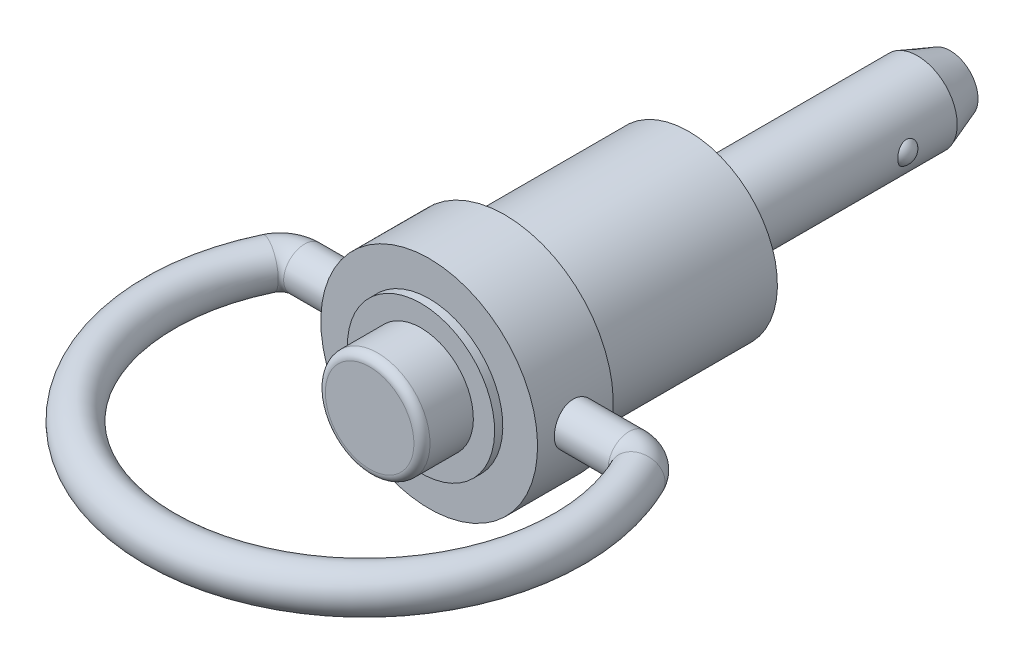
ISO-10303-21;
HEADER;
FILE_DESCRIPTION(('STEP AP214'),'2;1');
FILE_NAME('part.step','',(''),(''),'','','');
FILE_SCHEMA(('AUTOMOTIVE_DESIGN { 1 0 10303 214 1 1 1 1 }'));
ENDSEC;
DATA;
#1=APPLICATION_CONTEXT('core data for automotive mechanical design processes');
#2=APPLICATION_PROTOCOL_DEFINITION('international standard','automotive_design',2000,#1);
#3=PRODUCT_CONTEXT('',#1,'mechanical');
#4=PRODUCT('Part','Part','',(#3));
#5=PRODUCT_RELATED_PRODUCT_CATEGORY('part','',(#4));
#6=PRODUCT_DEFINITION_FORMATION('','',#4);
#7=PRODUCT_DEFINITION_CONTEXT('part definition',#1,'design');
#8=PRODUCT_DEFINITION('design','',#6,#7);
#9=PRODUCT_DEFINITION_SHAPE('','',#8);
#10=(LENGTH_UNIT() NAMED_UNIT(*) SI_UNIT(.MILLI.,.METRE.));
#11=(NAMED_UNIT(*) PLANE_ANGLE_UNIT() SI_UNIT($,.RADIAN.));
#12=(NAMED_UNIT(*) SI_UNIT($,.STERADIAN.) SOLID_ANGLE_UNIT());
#13=UNCERTAINTY_MEASURE_WITH_UNIT(LENGTH_MEASURE(1.E-05),#10,'distance_accuracy_value','');
#14=(GEOMETRIC_REPRESENTATION_CONTEXT(3) GLOBAL_UNCERTAINTY_ASSIGNED_CONTEXT((#13)) GLOBAL_UNIT_ASSIGNED_CONTEXT((#10,
#11,#12)) REPRESENTATION_CONTEXT('',''));
#15=CARTESIAN_POINT('',(0.,0.,0.));
#16=DIRECTION('',(0.,0.,1.));
#17=DIRECTION('',(1.,0.,0.));
#18=AXIS2_PLACEMENT_3D('',#15,#16,#17);
#19=CARTESIAN_POINT('',(0.,0.,20.828));
#20=DIRECTION('',(0.,0.,-1.));
#21=DIRECTION('',(0.,1.,0.));
#22=AXIS2_PLACEMENT_3D('',#19,#20,#21);
#23=CYLINDRICAL_SURFACE('',#22,3.2512);
#24=CARTESIAN_POINT('',(0.,0.,16.637));
#25=DIRECTION('',(0.,0.,-1.));
#26=DIRECTION('',(0.,1.,0.));
#27=AXIS2_PLACEMENT_3D('',#24,#25,#26);
#28=CIRCLE('',#27,3.2512);
#29=CARTESIAN_POINT('',(0.,3.25120000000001,16.637));
#30=VERTEX_POINT('',#29);
#31=EDGE_CURVE('E30',#30,#30,#28,.T.);
#32=ORIENTED_EDGE('',*,*,#31,.F.);
#33=EDGE_LOOP('',(#32));
#34=FACE_BOUND('',#33,.T.);
#35=CARTESIAN_POINT('',(0.,0.,19.328));
#36=DIRECTION('',(0.,0.,1.));
#37=DIRECTION('',(1.,0.,0.));
#38=AXIS2_PLACEMENT_3D('',#35,#36,#37);
#39=CIRCLE('',#38,3.2512);
#40=CARTESIAN_POINT('',(3.2512,0.,19.328));
#41=VERTEX_POINT('',#40);
#42=EDGE_CURVE('E136',#41,#41,#39,.T.);
#43=ORIENTED_EDGE('',*,*,#42,.F.);
#44=EDGE_LOOP('',(#43));
#45=FACE_BOUND('',#44,.T.);
#46=ADVANCED_FACE('F12',(#34,#45),#23,.T.);
#47=CARTESIAN_POINT('',(4.572,0.,16.637));
#48=DIRECTION('',(0.,0.,1.));
#49=DIRECTION('',(0.,-1.,0.));
#50=AXIS2_PLACEMENT_3D('',#47,#48,#49);
#51=PLANE('',#50);
#52=ORIENTED_EDGE('',*,*,#31,.T.);
#53=EDGE_LOOP('',(#52));
#54=FACE_BOUND('',#53,.T.);
#55=CARTESIAN_POINT('',(0.,0.,16.637));
#56=DIRECTION('',(0.,0.,-1.));
#57=DIRECTION('',(0.,1.,0.));
#58=AXIS2_PLACEMENT_3D('',#55,#56,#57);
#59=CIRCLE('',#58,4.572);
#60=CARTESIAN_POINT('',(0.,4.57200000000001,16.637));
#61=VERTEX_POINT('',#60);
#62=EDGE_CURVE('E35',#61,#61,#59,.T.);
#63=ORIENTED_EDGE('',*,*,#62,.F.);
#64=EDGE_LOOP('',(#63));
#65=FACE_BOUND('',#64,.T.);
#66=ADVANCED_FACE('F78',(#54,#65),#51,.T.);
#67=CARTESIAN_POINT('',(0.,0.,0.));
#68=DIRECTION('',(0.,0.,-1.));
#69=DIRECTION('',(0.,1.,0.));
#70=AXIS2_PLACEMENT_3D('',#67,#68,#69);
#71=CYLINDRICAL_SURFACE('',#70,4.572);
#72=ORIENTED_EDGE('',*,*,#62,.T.);
#73=EDGE_LOOP('',(#72));
#74=FACE_BOUND('',#73,.T.);
#75=CARTESIAN_POINT('',(0.,0.,16.129));
#76=DIRECTION('',(0.,0.,-1.));
#77=DIRECTION('',(0.,1.,0.));
#78=AXIS2_PLACEMENT_3D('',#75,#76,#77);
#79=CIRCLE('',#78,4.572);
#80=CARTESIAN_POINT('',(0.,4.57200000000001,16.129));
#81=VERTEX_POINT('',#80);
#82=EDGE_CURVE('E38',#81,#81,#79,.T.);
#83=ORIENTED_EDGE('',*,*,#82,.F.);
#84=EDGE_LOOP('',(#83));
#85=FACE_BOUND('',#84,.T.);
#86=ADVANCED_FACE('F155',(#74,#85),#71,.T.);
#87=CARTESIAN_POINT('',(6.731,0.,16.129));
#88=DIRECTION('',(0.,0.,1.));
#89=DIRECTION('',(0.,-1.,0.));
#90=AXIS2_PLACEMENT_3D('',#87,#88,#89);
#91=PLANE('',#90);
#92=CARTESIAN_POINT('',(0.,0.,16.129));
#93=DIRECTION('',(0.,0.,-1.));
#94=DIRECTION('',(0.,1.,0.));
#95=AXIS2_PLACEMENT_3D('',#92,#93,#94);
#96=CIRCLE('',#95,6.731);
#97=CARTESIAN_POINT('',(0.,6.73100000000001,16.129));
#98=VERTEX_POINT('',#97);
#99=EDGE_CURVE('E41',#98,#98,#96,.T.);
#100=ORIENTED_EDGE('',*,*,#99,.F.);
#101=EDGE_LOOP('',(#100));
#102=FACE_BOUND('',#101,.T.);
#103=ORIENTED_EDGE('',*,*,#82,.T.);
#104=EDGE_LOOP('',(#103));
#105=FACE_BOUND('',#104,.T.);
#106=ADVANCED_FACE('F196',(#102,#105),#91,.T.);
#107=CARTESIAN_POINT('',(0.,0.,0.));
#108=DIRECTION('',(0.,0.,-1.));
#109=DIRECTION('',(0.,1.,0.));
#110=AXIS2_PLACEMENT_3D('',#107,#108,#109);
#111=CYLINDRICAL_SURFACE('',#110,6.731);
#112=ORIENTED_EDGE('',*,*,#99,.T.);
#113=EDGE_LOOP('',(#112));
#114=FACE_BOUND('',#113,.T.);
#115=CARTESIAN_POINT('',(0.,0.,11.43));
#116=DIRECTION('',(0.,0.,-1.));
#117=DIRECTION('',(0.,1.,0.));
#118=AXIS2_PLACEMENT_3D('',#115,#116,#117);
#119=CIRCLE('',#118,6.731);
#120=CARTESIAN_POINT('',(0.,6.73100000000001,11.43));
#121=VERTEX_POINT('',#120);
#122=EDGE_CURVE('E44',#121,#121,#119,.T.);
#123=ORIENTED_EDGE('',*,*,#122,.F.);
#124=EDGE_LOOP('',(#123));
#125=FACE_BOUND('',#124,.T.);
#126=CARTESIAN_POINT('',(-6.60517220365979,1.2954,13.7922));
#127=CARTESIAN_POINT('',(-6.60517361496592,1.2953972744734,13.864236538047));
#128=CARTESIAN_POINT('',(-6.60636346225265,1.2893707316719,13.9363080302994));
#129=CARTESIAN_POINT('',(-6.61098794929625,1.26544153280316,14.0784162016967));
#130=CARTESIAN_POINT('',(-6.61442445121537,1.24752902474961,14.1484511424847));
#131=CARTESIAN_POINT('',(-6.62313895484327,1.20040052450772,14.2844095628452));
#132=CARTESIAN_POINT('',(-6.62841519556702,1.17119533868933,14.3503369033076));
#133=CARTESIAN_POINT('',(-6.64021258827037,1.10233951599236,14.4763528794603));
#134=CARTESIAN_POINT('',(-6.64673365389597,1.06268960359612,14.5364419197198));
#135=CARTESIAN_POINT('',(-6.66038139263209,0.973516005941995,14.6498669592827));
#136=CARTESIAN_POINT('',(-6.66751428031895,0.923881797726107,14.7031153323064));
#137=CARTESIAN_POINT('',(-6.68152715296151,0.816387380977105,14.8005834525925));
#138=CARTESIAN_POINT('',(-6.6884071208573,0.758526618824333,14.8448025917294));
#139=CARTESIAN_POINT('',(-6.7012057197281,0.635644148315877,14.9232944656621));
#140=CARTESIAN_POINT('',(-6.70711617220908,0.570568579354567,14.9574843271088));
#141=CARTESIAN_POINT('',(-6.71724013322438,0.435464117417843,15.014412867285));
#142=CARTESIAN_POINT('',(-6.72145378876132,0.365435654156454,15.0371525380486));
#143=CARTESIAN_POINT('',(-6.72766549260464,0.223321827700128,15.0702635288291));
#144=CARTESIAN_POINT('',(-6.72968999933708,0.15127208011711,15.0807826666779));
#145=CARTESIAN_POINT('',(-6.73138656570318,0.00640388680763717,15.089614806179));
#146=CARTESIAN_POINT('',(-6.73105883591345,-0.0664144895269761,15.0879289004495));
#147=CARTESIAN_POINT('',(-6.72810846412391,-0.20973839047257,15.072511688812));
#148=CARTESIAN_POINT('',(-6.72551615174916,-0.280261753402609,15.0589395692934));
#149=CARTESIAN_POINT('',(-6.71836197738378,-0.418011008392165,15.0203872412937));
#150=CARTESIAN_POINT('',(-6.71380004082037,-0.485236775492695,14.9954066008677));
#151=CARTESIAN_POINT('',(-6.70316878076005,-0.614941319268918,14.9345963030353));
#152=CARTESIAN_POINT('',(-6.69709072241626,-0.677389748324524,14.8987035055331));
#153=CARTESIAN_POINT('',(-6.68409856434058,-0.795436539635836,14.8171343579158));
#154=CARTESIAN_POINT('',(-6.677184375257,-0.851034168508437,14.7714569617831));
#155=CARTESIAN_POINT('',(-6.66315320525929,-0.95474491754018,14.6707395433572));
#156=CARTESIAN_POINT('',(-6.65603475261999,-1.00272266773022,14.6155602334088));
#157=CARTESIAN_POINT('',(-6.64250376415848,-1.08876420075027,14.4978679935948));
#158=CARTESIAN_POINT('',(-6.63609123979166,-1.12682782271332,14.4353549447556));
#159=CARTESIAN_POINT('',(-6.62469571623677,-1.19200234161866,14.3045844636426));
#160=CARTESIAN_POINT('',(-6.61971540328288,-1.21909269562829,14.2363165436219));
#161=CARTESIAN_POINT('',(-6.61178862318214,-1.26138008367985,14.0960804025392));
#162=CARTESIAN_POINT('',(-6.60884191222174,-1.27657854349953,14.0241126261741));
#163=CARTESIAN_POINT('',(-6.60536444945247,-1.29445125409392,13.8797427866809));
#164=CARTESIAN_POINT('',(-6.60479610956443,-1.29732037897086,13.8073657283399));
#165=CARTESIAN_POINT('',(-6.60603903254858,-1.29097613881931,13.6631669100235));
#166=CARTESIAN_POINT('',(-6.60785017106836,-1.28176340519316,13.5913451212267));
#167=CARTESIAN_POINT('',(-6.6136128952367,-1.25168453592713,13.4509418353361));
#168=CARTESIAN_POINT('',(-6.61754556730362,-1.23092132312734,13.3823374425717));
#169=CARTESIAN_POINT('',(-6.62709183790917,-1.17844042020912,13.249581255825));
#170=CARTESIAN_POINT('',(-6.63270556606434,-1.14672188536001,13.1854298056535));
#171=CARTESIAN_POINT('',(-6.64506657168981,-1.07278507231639,13.0625442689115));
#172=CARTESIAN_POINT('',(-6.65182676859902,-1.03044414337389,13.0038853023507));
#173=CARTESIAN_POINT('',(-6.66568301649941,-0.93662909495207,12.8944341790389));
#174=CARTESIAN_POINT('',(-6.67277909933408,-0.885154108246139,12.8436427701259));
#175=CARTESIAN_POINT('',(-6.68662882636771,-0.77366002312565,12.7506362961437));
#176=CARTESIAN_POINT('',(-6.69337621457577,-0.713530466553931,12.7085525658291));
#177=CARTESIAN_POINT('',(-6.70566168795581,-0.58694148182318,12.6350847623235));
#178=CARTESIAN_POINT('',(-6.71119982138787,-0.520482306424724,12.6037002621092));
#179=CARTESIAN_POINT('',(-6.72041595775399,-0.383476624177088,12.5527164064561));
#180=CARTESIAN_POINT('',(-6.72410395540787,-0.312954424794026,12.5330536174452));
#181=CARTESIAN_POINT('',(-6.72924701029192,-0.169530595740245,12.5058694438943));
#182=CARTESIAN_POINT('',(-6.7307023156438,-0.0966292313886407,12.4983467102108));
#183=CARTESIAN_POINT('',(-6.73121071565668,0.0482259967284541,12.4957052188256));
#184=CARTESIAN_POINT('',(-6.73030215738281,0.1201761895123,12.5003884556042));
#185=CARTESIAN_POINT('',(-6.72626496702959,0.262244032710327,12.5215909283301));
#186=CARTESIAN_POINT('',(-6.72313635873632,0.332361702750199,12.5381100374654));
#187=CARTESIAN_POINT('',(-6.71501101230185,0.468662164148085,12.5824301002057));
#188=CARTESIAN_POINT('',(-6.710017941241,0.534852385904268,12.6102089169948));
#189=CARTESIAN_POINT('',(-6.69870305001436,0.661661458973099,12.6762356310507));
#190=CARTESIAN_POINT('',(-6.69238113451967,0.722279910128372,12.7144842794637));
#191=CARTESIAN_POINT('',(-6.6789853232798,0.83720844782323,12.8010411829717));
#192=CARTESIAN_POINT('',(-6.67190155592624,0.891410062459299,12.8494919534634));
#193=CARTESIAN_POINT('',(-6.65784127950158,0.990982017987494,12.95478313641));
#194=CARTESIAN_POINT('',(-6.65086479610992,1.03635027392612,13.0116255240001));
#195=CARTESIAN_POINT('',(-6.63773378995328,1.1173887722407,13.1327559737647));
#196=CARTESIAN_POINT('',(-6.63158802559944,1.15295925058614,13.1971117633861));
#197=CARTESIAN_POINT('',(-6.62092027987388,1.21272619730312,13.3309847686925));
#198=CARTESIAN_POINT('',(-6.61639678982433,1.23693323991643,13.4004971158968));
#199=CARTESIAN_POINT('',(-6.61041337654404,1.26845390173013,13.5238636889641));
#200=CARTESIAN_POINT('',(-6.60845980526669,1.27854107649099,13.57700269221));
#201=CARTESIAN_POINT('',(-6.60583870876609,1.29201504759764,13.6841545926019));
#202=CARTESIAN_POINT('',(-6.60517114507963,1.29540204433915,13.7381674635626));
#203=CARTESIAN_POINT('',(-6.60517220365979,1.2954,13.7922));
#204=B_SPLINE_CURVE_WITH_KNOTS('',3,(#126,#127,#128,#129,#130,#131,#132,#133,#134,#135,#136,
#137,#138,#139,#140,#141,#142,#143,#144,#145,#146,#147,#148,#149,#150,#151,#152,#153,#154,#155,
#156,#157,#158,#159,#160,#161,#162,#163,#164,#165,#166,#167,#168,#169,#170,#171,#172,#173,#174,
#175,#176,#177,#178,#179,#180,#181,#182,#183,#184,#185,#186,#187,#188,#189,#190,#191,#192,#193,
#194,#195,#196,#197,#198,#199,#200,#201,#202,#203),.UNSPECIFIED.,.T.,.F.,(4,2,2,2,2,2,2,2,2,2,2,
2,2,2,2,2,2,2,2,2,2,2,2,2,2,2,2,2,2,2,2,2,2,2,2,2,2,2,4),(0.,0.215911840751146,
0.432002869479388,0.647887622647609,0.863757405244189,1.08216318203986,1.30058366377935,
1.52076118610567,1.74091962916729,1.95838638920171,2.1758336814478,2.39041258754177,
2.60499961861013,2.82085272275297,3.0367289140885,3.25609136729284,3.47545737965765,
3.69523218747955,3.91498064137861,4.13124273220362,4.34749352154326,4.56184753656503,
4.7762180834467,4.99318797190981,5.21017847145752,5.43023526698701,5.65028327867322,
5.86912939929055,6.08795119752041,6.30324544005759,6.51853737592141,6.73340808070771,
6.94829420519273,7.16640910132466,7.38457541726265,7.60488731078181,7.82499378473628,
7.98694789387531,8.14889715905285),.UNSPECIFIED.);
#205=CARTESIAN_POINT('',(-6.60517220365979,1.2954,13.7922));
#206=VERTEX_POINT('',#205);
#207=EDGE_CURVE('E27',#206,#206,#204,.T.);
#208=ORIENTED_EDGE('',*,*,#207,.T.);
#209=EDGE_LOOP('',(#208));
#210=FACE_BOUND('',#209,.T.);
#211=CARTESIAN_POINT('',(6.60517220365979,1.2954,13.7922));
#212=CARTESIAN_POINT('',(6.60517361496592,1.2953972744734,13.720163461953));
#213=CARTESIAN_POINT('',(6.60636346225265,1.2893707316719,13.6480919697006));
#214=CARTESIAN_POINT('',(6.61098794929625,1.26544153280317,13.5059837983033));
#215=CARTESIAN_POINT('',(6.61442445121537,1.24752902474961,13.4359488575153));
#216=CARTESIAN_POINT('',(6.62313895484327,1.20040052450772,13.2999904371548));
#217=CARTESIAN_POINT('',(6.62841519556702,1.17119533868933,13.2340630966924));
#218=CARTESIAN_POINT('',(6.64021258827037,1.10233951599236,13.1080471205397));
#219=CARTESIAN_POINT('',(6.64673365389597,1.06268960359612,13.0479580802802));
#220=CARTESIAN_POINT('',(6.66038139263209,0.973516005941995,12.9345330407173));
#221=CARTESIAN_POINT('',(6.66751428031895,0.923881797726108,12.8812846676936));
#222=CARTESIAN_POINT('',(6.68152715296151,0.816387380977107,12.7838165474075));
#223=CARTESIAN_POINT('',(6.6884071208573,0.758526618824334,12.7395974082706));
#224=CARTESIAN_POINT('',(6.7012057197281,0.635644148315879,12.6611055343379));
#225=CARTESIAN_POINT('',(6.70711617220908,0.570568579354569,12.6269156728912));
#226=CARTESIAN_POINT('',(6.71724013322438,0.435464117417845,12.569987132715));
#227=CARTESIAN_POINT('',(6.72145378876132,0.365435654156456,12.5472474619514));
#228=CARTESIAN_POINT('',(6.72766549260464,0.22332182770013,12.5141364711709));
#229=CARTESIAN_POINT('',(6.72968999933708,0.151272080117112,12.5036173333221));
#230=CARTESIAN_POINT('',(6.73138656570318,0.00640388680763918,12.494785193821));
#231=CARTESIAN_POINT('',(6.73105883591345,-0.0664144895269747,12.4964710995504));
#232=CARTESIAN_POINT('',(6.72810846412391,-0.209738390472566,12.511888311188));
#233=CARTESIAN_POINT('',(6.72551615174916,-0.280261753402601,12.5254604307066));
#234=CARTESIAN_POINT('',(6.71836197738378,-0.418011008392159,12.5640127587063));
#235=CARTESIAN_POINT('',(6.71380004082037,-0.485236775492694,12.5889933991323));
#236=CARTESIAN_POINT('',(6.70316878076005,-0.614941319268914,12.6498036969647));
#237=CARTESIAN_POINT('',(6.69709072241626,-0.677389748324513,12.6856964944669));
#238=CARTESIAN_POINT('',(6.68409856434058,-0.795436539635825,12.7672656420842));
#239=CARTESIAN_POINT('',(6.677184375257,-0.851034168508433,12.8129430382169));
#240=CARTESIAN_POINT('',(6.66315320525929,-0.954744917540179,12.9136604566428));
#241=CARTESIAN_POINT('',(6.65603475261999,-1.00272266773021,12.9688397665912));
#242=CARTESIAN_POINT('',(6.64250376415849,-1.08876420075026,13.0865320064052));
#243=CARTESIAN_POINT('',(6.63609123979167,-1.12682782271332,13.1490450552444));
#244=CARTESIAN_POINT('',(6.62469571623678,-1.19200234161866,13.2798155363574));
#245=CARTESIAN_POINT('',(6.61971540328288,-1.21909269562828,13.3480834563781));
#246=CARTESIAN_POINT('',(6.61178862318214,-1.26138008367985,13.4883195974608));
#247=CARTESIAN_POINT('',(6.60884191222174,-1.27657854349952,13.5602873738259));
#248=CARTESIAN_POINT('',(6.60536444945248,-1.29445125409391,13.7046572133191));
#249=CARTESIAN_POINT('',(6.60479610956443,-1.29732037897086,13.7770342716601));
#250=CARTESIAN_POINT('',(6.60603903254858,-1.29097613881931,13.9212330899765));
#251=CARTESIAN_POINT('',(6.60785017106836,-1.28176340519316,13.9930548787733));
#252=CARTESIAN_POINT('',(6.6136128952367,-1.25168453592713,14.1334581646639));
#253=CARTESIAN_POINT('',(6.61754556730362,-1.23092132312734,14.2020625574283));
#254=CARTESIAN_POINT('',(6.62709183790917,-1.17844042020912,14.334818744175));
#255=CARTESIAN_POINT('',(6.63270556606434,-1.14672188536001,14.3989701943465));
#256=CARTESIAN_POINT('',(6.64506657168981,-1.07278507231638,14.5218557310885));
#257=CARTESIAN_POINT('',(6.65182676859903,-1.03044414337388,14.5805146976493));
#258=CARTESIAN_POINT('',(6.66568301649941,-0.936629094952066,14.6899658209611));
#259=CARTESIAN_POINT('',(6.67277909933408,-0.885154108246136,14.7407572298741));
#260=CARTESIAN_POINT('',(6.68662882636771,-0.773660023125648,14.8337637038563));
#261=CARTESIAN_POINT('',(6.69337621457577,-0.713530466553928,14.8758474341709));
#262=CARTESIAN_POINT('',(6.70566168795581,-0.586941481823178,14.9493152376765));
#263=CARTESIAN_POINT('',(6.71119982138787,-0.520482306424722,14.9806997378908));
#264=CARTESIAN_POINT('',(6.72041595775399,-0.383476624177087,15.0316835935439));
#265=CARTESIAN_POINT('',(6.72410395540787,-0.312954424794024,15.0513463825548));
#266=CARTESIAN_POINT('',(6.72924701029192,-0.169530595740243,15.0785305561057));
#267=CARTESIAN_POINT('',(6.7307023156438,-0.0966292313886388,15.0860532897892));
#268=CARTESIAN_POINT('',(6.73121071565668,0.0482259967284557,15.0886947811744));
#269=CARTESIAN_POINT('',(6.73030215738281,0.120176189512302,15.0840115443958));
#270=CARTESIAN_POINT('',(6.72626496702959,0.262244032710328,15.0628090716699));
#271=CARTESIAN_POINT('',(6.72313635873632,0.3323617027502,15.0462899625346));
#272=CARTESIAN_POINT('',(6.71501101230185,0.468662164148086,15.0019698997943));
#273=CARTESIAN_POINT('',(6.710017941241,0.534852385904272,14.9741910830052));
#274=CARTESIAN_POINT('',(6.69870305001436,0.661661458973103,14.9081643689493));
#275=CARTESIAN_POINT('',(6.69238113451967,0.722279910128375,14.8699157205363));
#276=CARTESIAN_POINT('',(6.6789853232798,0.837208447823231,14.7833588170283));
#277=CARTESIAN_POINT('',(6.67190155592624,0.8914100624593,14.7349080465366));
#278=CARTESIAN_POINT('',(6.65784127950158,0.990982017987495,14.62961686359));
#279=CARTESIAN_POINT('',(6.65086479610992,1.03635027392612,14.5727744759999));
#280=CARTESIAN_POINT('',(6.63773378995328,1.1173887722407,14.4516440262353));
#281=CARTESIAN_POINT('',(6.63158802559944,1.15295925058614,14.3872882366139));
#282=CARTESIAN_POINT('',(6.62092027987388,1.21272619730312,14.2534152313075));
#283=CARTESIAN_POINT('',(6.61639678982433,1.23693323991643,14.1839028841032));
#284=CARTESIAN_POINT('',(6.61041337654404,1.26845390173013,14.0605363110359));
#285=CARTESIAN_POINT('',(6.60845980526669,1.278541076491,14.00739730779));
#286=CARTESIAN_POINT('',(6.60583870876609,1.29201504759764,13.9002454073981));
#287=CARTESIAN_POINT('',(6.60517114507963,1.29540204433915,13.8462325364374));
#288=CARTESIAN_POINT('',(6.60517220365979,1.2954,13.7922));
#289=B_SPLINE_CURVE_WITH_KNOTS('',3,(#211,#212,#213,#214,#215,#216,#217,#218,#219,#220,#221,
#222,#223,#224,#225,#226,#227,#228,#229,#230,#231,#232,#233,#234,#235,#236,#237,#238,#239,#240,
#241,#242,#243,#244,#245,#246,#247,#248,#249,#250,#251,#252,#253,#254,#255,#256,#257,#258,#259,
#260,#261,#262,#263,#264,#265,#266,#267,#268,#269,#270,#271,#272,#273,#274,#275,#276,#277,#278,
#279,#280,#281,#282,#283,#284,#285,#286,#287,#288),.UNSPECIFIED.,.T.,.F.,(4,2,2,2,2,2,2,2,2,2,2,
2,2,2,2,2,2,2,2,2,2,2,2,2,2,2,2,2,2,2,2,2,2,2,2,2,2,2,4),(0.,0.215911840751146,
0.432002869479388,0.647887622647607,0.86375740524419,1.08216318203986,1.30058366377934,
1.52076118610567,1.74091962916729,1.95838638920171,2.1758336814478,2.39041258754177,
2.60499961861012,2.82085272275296,3.03672891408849,3.25609136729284,3.47545737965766,
3.69523218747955,3.91498064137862,4.13124273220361,4.34749352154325,4.56184753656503,
4.7762180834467,4.99318797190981,5.21017847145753,5.43023526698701,5.65028327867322,
5.86912939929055,6.08795119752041,6.30324544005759,6.51853737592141,6.73340808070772,
6.94829420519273,7.16640910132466,7.38457541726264,7.60488731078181,7.82499378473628,
7.98694789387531,8.14889715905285),.UNSPECIFIED.);
#290=CARTESIAN_POINT('',(6.60517220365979,1.2954,13.7922));
#291=VERTEX_POINT('',#290);
#292=EDGE_CURVE('E23',#291,#291,#289,.T.);
#293=ORIENTED_EDGE('',*,*,#292,.T.);
#294=EDGE_LOOP('',(#293));
#295=FACE_BOUND('',#294,.T.);
#296=ADVANCED_FACE('F147',(#114,#125,#210,#295),#111,.T.);
#297=CARTESIAN_POINT('',(5.7785,0.,11.43));
#298=DIRECTION('',(0.,0.,-1.));
#299=DIRECTION('',(0.,1.,0.));
#300=AXIS2_PLACEMENT_3D('',#297,#298,#299);
#301=PLANE('',#300);
#302=CARTESIAN_POINT('',(0.,0.,11.43));
#303=DIRECTION('',(0.,0.,-1.));
#304=DIRECTION('',(0.,1.,0.));
#305=AXIS2_PLACEMENT_3D('',#302,#303,#304);
#306=CIRCLE('',#305,5.9);
#307=CARTESIAN_POINT('',(0.,5.9,11.43));
#308=VERTEX_POINT('',#307);
#309=EDGE_CURVE('E19',#308,#308,#306,.F.);
#310=ORIENTED_EDGE('',*,*,#309,.T.);
#311=EDGE_LOOP('',(#310));
#312=FACE_BOUND('',#311,.T.);
#313=ORIENTED_EDGE('',*,*,#122,.T.);
#314=EDGE_LOOP('',(#313));
#315=FACE_BOUND('',#314,.T.);
#316=ADVANCED_FACE('F141',(#312,#315),#301,.T.);
#317=CARTESIAN_POINT('',(10.0803124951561,0.,15.3162));
#318=DIRECTION('',(0.,1.,0.));
#319=DIRECTION('',(-1.,0.,0.));
#320=AXIS2_PLACEMENT_3D('',#317,#318,#319);
#321=TOROIDAL_SURFACE('',#320,1.524,1.2954);
#322=CARTESIAN_POINT('',(11.4549005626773,0.,14.658109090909));
#323=DIRECTION('',(-0.431818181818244,0.,-0.901960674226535));
#324=DIRECTION('',(0.901960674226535,0.,-0.431818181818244));
#325=AXIS2_PLACEMENT_3D('',#322,#323,#324);
#326=CIRCLE('',#325,1.2954);
#327=CARTESIAN_POINT('',(12.6233004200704,0.,14.0987318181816));
#328=VERTEX_POINT('',#327);
#329=EDGE_CURVE('E48',#328,#328,#326,.T.);
#330=ORIENTED_EDGE('',*,*,#329,.T.);
#331=EDGE_LOOP('',(#330));
#332=FACE_BOUND('',#331,.T.);
#333=CARTESIAN_POINT('',(10.0803124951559,0.,13.7922));
#334=DIRECTION('',(1.,0.,0.));
#335=DIRECTION('',(0.,1.,0.));
#336=AXIS2_PLACEMENT_3D('',#333,#334,#335);
#337=CIRCLE('',#336,1.2954);
#338=CARTESIAN_POINT('',(10.0803124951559,1.29540000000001,13.7922));
#339=VERTEX_POINT('',#338);
#340=EDGE_CURVE('E34',#339,#339,#337,.F.);
#341=ORIENTED_EDGE('',*,*,#340,.F.);
#342=EDGE_LOOP('',(#341));
#343=FACE_BOUND('',#342,.T.);
#344=ADVANCED_FACE('F76',(#332,#343),#321,.T.);
#345=CARTESIAN_POINT('',(-10.0803124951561,0.,13.7922));
#346=DIRECTION('',(1.,0.,0.));
#347=DIRECTION('',(0.,1.,0.));
#348=AXIS2_PLACEMENT_3D('',#345,#346,#347);
#349=CYLINDRICAL_SURFACE('',#348,1.2954);
#350=ORIENTED_EDGE('',*,*,#292,.F.);
#351=EDGE_LOOP('',(#350));
#352=FACE_BOUND('',#351,.T.);
#353=ORIENTED_EDGE('',*,*,#340,.T.);
#354=EDGE_LOOP('',(#353));
#355=FACE_BOUND('',#354,.T.);
#356=ADVANCED_FACE('F72',(#352,#355),#349,.T.);
#357=CARTESIAN_POINT('',(0.,0.,20.1422));
#358=DIRECTION('',(0.,1.,0.));
#359=DIRECTION('',(-1.,0.,0.));
#360=AXIS2_PLACEMENT_3D('',#357,#358,#359);
#361=TOROIDAL_SURFACE('',#360,12.7,1.2954);
#362=CARTESIAN_POINT('',(-11.4549005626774,0.,14.6581090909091));
#363=DIRECTION('',(-0.43181818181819,0.,0.901960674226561));
#364=DIRECTION('',(-0.901960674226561,0.,-0.43181818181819));
#365=AXIS2_PLACEMENT_3D('',#362,#363,#364);
#366=CIRCLE('',#365,1.2954);
#367=CARTESIAN_POINT('',(-12.6233004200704,0.,14.0987318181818));
#368=VERTEX_POINT('',#367);
#369=EDGE_CURVE('E51',#368,#368,#366,.F.);
#370=ORIENTED_EDGE('',*,*,#369,.F.);
#371=EDGE_LOOP('',(#370));
#372=FACE_BOUND('',#371,.T.);
#373=ORIENTED_EDGE('',*,*,#329,.F.);
#374=EDGE_LOOP('',(#373));
#375=FACE_BOUND('',#374,.T.);
#376=ADVANCED_FACE('F69',(#372,#375),#361,.T.);
#377=CARTESIAN_POINT('',(-10.0803124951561,0.,15.3162));
#378=DIRECTION('',(0.,1.,0.));
#379=DIRECTION('',(-1.,0.,0.));
#380=AXIS2_PLACEMENT_3D('',#377,#378,#379);
#381=TOROIDAL_SURFACE('',#380,1.524,1.2954);
#382=CARTESIAN_POINT('',(-10.0803124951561,0.,13.7922));
#383=DIRECTION('',(1.,0.,0.));
#384=DIRECTION('',(0.,1.,0.));
#385=AXIS2_PLACEMENT_3D('',#382,#383,#384);
#386=CIRCLE('',#385,1.2954);
#387=CARTESIAN_POINT('',(-10.0803124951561,1.2954,13.7922));
#388=VERTEX_POINT('',#387);
#389=EDGE_CURVE('E33',#388,#388,#386,.T.);
#390=ORIENTED_EDGE('',*,*,#389,.F.);
#391=EDGE_LOOP('',(#390));
#392=FACE_BOUND('',#391,.T.);
#393=ORIENTED_EDGE('',*,*,#369,.T.);
#394=EDGE_LOOP('',(#393));
#395=FACE_BOUND('',#394,.T.);
#396=ADVANCED_FACE('F64',(#392,#395),#381,.T.);
#397=CARTESIAN_POINT('',(-10.0803124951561,0.,13.7922));
#398=DIRECTION('',(1.,0.,0.));
#399=DIRECTION('',(0.,1.,0.));
#400=AXIS2_PLACEMENT_3D('',#397,#398,#399);
#401=CYLINDRICAL_SURFACE('',#400,1.2954);
#402=ORIENTED_EDGE('',*,*,#207,.F.);
#403=EDGE_LOOP('',(#402));
#404=FACE_BOUND('',#403,.T.);
#405=ORIENTED_EDGE('',*,*,#389,.T.);
#406=EDGE_LOOP('',(#405));
#407=FACE_BOUND('',#406,.T.);
#408=ADVANCED_FACE('F68',(#404,#407),#401,.T.);
#409=CARTESIAN_POINT('',(0.,0.,19.328));
#410=DIRECTION('',(0.,0.,1.));
#411=DIRECTION('',(1.,0.,0.));
#412=AXIS2_PLACEMENT_3D('',#409,#410,#411);
#413=TOROIDAL_SURFACE('',#412,2.7512,0.5);
#414=CARTESIAN_POINT('',(0.,0.,19.828));
#415=DIRECTION('',(0.,0.,1.));
#416=DIRECTION('',(1.,0.,0.));
#417=AXIS2_PLACEMENT_3D('',#414,#415,#416);
#418=CIRCLE('',#417,2.7512);
#419=CARTESIAN_POINT('',(2.7512,0.,19.828));
#420=VERTEX_POINT('',#419);
#421=EDGE_CURVE('E162',#420,#420,#418,.T.);
#422=ORIENTED_EDGE('',*,*,#421,.F.);
#423=EDGE_LOOP('',(#422));
#424=FACE_BOUND('',#423,.T.);
#425=ORIENTED_EDGE('',*,*,#42,.T.);
#426=EDGE_LOOP('',(#425));
#427=FACE_BOUND('',#426,.T.);
#428=ADVANCED_FACE('F94',(#424,#427),#413,.T.);
#429=CARTESIAN_POINT('',(0.,0.,19.828));
#430=DIRECTION('',(0.,0.,-1.));
#431=DIRECTION('',(-1.,0.,0.));
#432=AXIS2_PLACEMENT_3D('',#429,#430,#431);
#433=PLANE('',#432);
#434=ORIENTED_EDGE('',*,*,#421,.T.);
#435=EDGE_LOOP('',(#434));
#436=FACE_BOUND('',#435,.T.);
#437=ADVANCED_FACE('F173',(#436),#433,.F.);
#438=CARTESIAN_POINT('',(0.,0.,32.4379532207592));
#439=DIRECTION('',(0.,0.,-1.));
#440=DIRECTION('',(0.,1.,0.));
#441=AXIS2_PLACEMENT_3D('',#438,#439,#440);
#442=CYLINDRICAL_SURFACE('',#441,5.5);
#443=CARTESIAN_POINT('',(0.,0.,11.03));
#444=DIRECTION('',(0.,0.,-1.));
#445=DIRECTION('',(0.,1.,0.));
#446=AXIS2_PLACEMENT_3D('',#443,#444,#445);
#447=CIRCLE('',#446,5.5);
#448=CARTESIAN_POINT('',(0.,5.5,11.03));
#449=VERTEX_POINT('',#448);
#450=EDGE_CURVE('E8',#449,#449,#447,.T.);
#451=ORIENTED_EDGE('',*,*,#450,.T.);
#452=EDGE_LOOP('',(#451));
#453=FACE_BOUND('',#452,.T.);
#454=CARTESIAN_POINT('',(0.,0.,0.));
#455=DIRECTION('',(0.,0.,-1.));
#456=DIRECTION('',(0.,1.,0.));
#457=AXIS2_PLACEMENT_3D('',#454,#455,#456);
#458=CIRCLE('',#457,5.5);
#459=CARTESIAN_POINT('',(0.,5.5,0.));
#460=VERTEX_POINT('',#459);
#461=EDGE_CURVE('E164',#460,#460,#458,.T.);
#462=ORIENTED_EDGE('',*,*,#461,.F.);
#463=EDGE_LOOP('',(#462));
#464=FACE_BOUND('',#463,.T.);
#465=ADVANCED_FACE('F101',(#453,#464),#442,.T.);
#466=CARTESIAN_POINT('',(1.73119748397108,0.,-16.2306));
#467=DIRECTION('',(0.,0.,1.));
#468=DIRECTION('',(0.,-1.,0.));
#469=AXIS2_PLACEMENT_3D('',#466,#467,#468);
#470=PLANE('',#469);
#471=CARTESIAN_POINT('',(0.,0.,-16.2306000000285));
#472=DIRECTION('',(0.,0.,1.));
#473=DIRECTION('',(-1.,0.,0.));
#474=AXIS2_PLACEMENT_3D('',#471,#472,#473);
#475=CIRCLE('',#474,1.73119748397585);
#476=CARTESIAN_POINT('',(-1.73119748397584,0.,-16.2306000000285));
#477=VERTEX_POINT('',#476);
#478=EDGE_CURVE('E134',#477,#477,#475,.T.);
#479=ORIENTED_EDGE('',*,*,#478,.F.);
#480=EDGE_LOOP('',(#479));
#481=FACE_BOUND('',#480,.T.);
#482=ADVANCED_FACE('F96',(#481),#470,.F.);
#483=CARTESIAN_POINT('',(1.97739,0.,-11.1252));
#484=DIRECTION('',(0.,0.,1.));
#485=DIRECTION('',(1.,0.,0.));
#486=AXIS2_PLACEMENT_3D('',#483,#484,#485);
#487=SPHERICAL_SURFACE('',#486,0.79375);
#488=CARTESIAN_POINT('',(2.470785,0.,-10.5034279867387));
#489=CARTESIAN_POINT('',(2.47078450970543,0.0407779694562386,-10.5034284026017));
#490=CARTESIAN_POINT('',(2.46976664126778,0.0815627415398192,-10.5066414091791));
#491=CARTESIAN_POINT('',(2.46579298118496,0.162087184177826,-10.5194782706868));
#492=CARTESIAN_POINT('',(2.46283382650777,0.201824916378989,-10.5291132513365));
#493=CARTESIAN_POINT('',(2.45527981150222,0.279082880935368,-10.5547224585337));
#494=CARTESIAN_POINT('',(2.45068366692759,0.316601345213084,-10.5707016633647));
#495=CARTESIAN_POINT('',(2.44036557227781,0.388204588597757,-10.6088086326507));
#496=CARTESIAN_POINT('',(2.43464406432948,0.422290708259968,-10.6309339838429));
#497=CARTESIAN_POINT('',(2.42293774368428,0.484910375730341,-10.6802681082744));
#498=CARTESIAN_POINT('',(2.41696529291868,0.513575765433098,-10.7073117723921));
#499=CARTESIAN_POINT('',(2.40537490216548,0.565381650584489,-10.7663344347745));
#500=CARTESIAN_POINT('',(2.39975676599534,0.588525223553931,-10.7983106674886));
#501=CARTESIAN_POINT('',(2.39013715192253,0.626395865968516,-10.8632598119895));
#502=CARTESIAN_POINT('',(2.38603581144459,0.641692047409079,-10.8958854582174));
#503=CARTESIAN_POINT('',(2.37935105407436,0.666054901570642,-10.9635277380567));
#504=CARTESIAN_POINT('',(2.37676637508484,0.675126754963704,-10.9985423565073));
#505=CARTESIAN_POINT('',(2.37365169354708,0.685991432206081,-11.0661524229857));
#506=CARTESIAN_POINT('',(2.37294150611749,0.688423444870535,-11.0986379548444));
#507=CARTESIAN_POINT('',(2.37313557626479,0.687754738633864,-11.1635427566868));
#508=CARTESIAN_POINT('',(2.37403937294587,0.684655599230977,-11.1959620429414));
#509=CARTESIAN_POINT('',(2.37727684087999,0.673323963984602,-11.258349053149));
#510=CARTESIAN_POINT('',(2.37954686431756,0.665319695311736,-11.2883621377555));
#511=CARTESIAN_POINT('',(2.38521427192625,0.644705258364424,-11.3466434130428));
#512=CARTESIAN_POINT('',(2.38861178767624,0.632094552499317,-11.374911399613));
#513=CARTESIAN_POINT('',(2.39633342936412,0.602171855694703,-11.4300782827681));
#514=CARTESIAN_POINT('',(2.40068724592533,0.584702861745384,-11.4568875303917));
#515=CARTESIAN_POINT('',(2.40981924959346,0.545846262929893,-11.5074782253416));
#516=CARTESIAN_POINT('',(2.41459823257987,0.524451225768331,-11.5312537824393));
#517=CARTESIAN_POINT('',(2.42457469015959,0.476310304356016,-11.5773361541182));
#518=CARTESIAN_POINT('',(2.42977140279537,0.449257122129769,-11.5993219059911));
#519=CARTESIAN_POINT('',(2.43965148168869,0.392072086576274,-11.6388785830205));
#520=CARTESIAN_POINT('',(2.44433535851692,0.361943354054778,-11.6564539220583));
#521=CARTESIAN_POINT('',(2.45319212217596,0.296347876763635,-11.6884994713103));
#522=CARTESIAN_POINT('',(2.45727382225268,0.260646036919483,-11.7025143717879));
#523=CARTESIAN_POINT('',(2.4639385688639,0.187441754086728,-11.7249081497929));
#524=CARTESIAN_POINT('',(2.46652349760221,0.149941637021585,-11.7332941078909));
#525=CARTESIAN_POINT('',(2.46992655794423,0.0749487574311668,-11.7442592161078));
#526=CARTESIAN_POINT('',(2.47078545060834,0.0374772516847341,-11.7469723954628));
#527=CARTESIAN_POINT('',(2.47078450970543,-0.0407779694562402,-11.7469715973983));
#528=CARTESIAN_POINT('',(2.46976664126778,-0.0815627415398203,-11.7437585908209));
#529=CARTESIAN_POINT('',(2.46579298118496,-0.162087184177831,-11.7309217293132));
#530=CARTESIAN_POINT('',(2.46283382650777,-0.201824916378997,-11.7212867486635));
#531=CARTESIAN_POINT('',(2.45527981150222,-0.279082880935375,-11.6956775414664));
#532=CARTESIAN_POINT('',(2.45068366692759,-0.316601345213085,-11.6796983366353));
#533=CARTESIAN_POINT('',(2.44036557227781,-0.38820458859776,-11.6415913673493));
#534=CARTESIAN_POINT('',(2.43464406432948,-0.422290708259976,-11.6194660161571));
#535=CARTESIAN_POINT('',(2.42293774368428,-0.484910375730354,-11.5701318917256));
#536=CARTESIAN_POINT('',(2.41696529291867,-0.51357576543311,-11.5430882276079));
#537=CARTESIAN_POINT('',(2.40537490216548,-0.565381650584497,-11.4840655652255));
#538=CARTESIAN_POINT('',(2.39975676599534,-0.588525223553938,-11.4520893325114));
#539=CARTESIAN_POINT('',(2.39013715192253,-0.62639586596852,-11.3871401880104));
#540=CARTESIAN_POINT('',(2.38603581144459,-0.641692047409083,-11.3545145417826));
#541=CARTESIAN_POINT('',(2.37935105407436,-0.666054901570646,-11.2868722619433));
#542=CARTESIAN_POINT('',(2.37676637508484,-0.675126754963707,-11.2518576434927));
#543=CARTESIAN_POINT('',(2.37365169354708,-0.685991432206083,-11.1842475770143));
#544=CARTESIAN_POINT('',(2.37294150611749,-0.688423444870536,-11.1517620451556));
#545=CARTESIAN_POINT('',(2.3731355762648,-0.687754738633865,-11.0868572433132));
#546=CARTESIAN_POINT('',(2.37403937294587,-0.684655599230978,-11.0544379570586));
#547=CARTESIAN_POINT('',(2.37727684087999,-0.673323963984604,-10.992050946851));
#548=CARTESIAN_POINT('',(2.37954686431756,-0.665319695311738,-10.9620378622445));
#549=CARTESIAN_POINT('',(2.38521427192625,-0.644705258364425,-10.9037565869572));
#550=CARTESIAN_POINT('',(2.38861178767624,-0.632094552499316,-10.875488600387));
#551=CARTESIAN_POINT('',(2.39633342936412,-0.602171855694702,-10.8203217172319));
#552=CARTESIAN_POINT('',(2.40068724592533,-0.584702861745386,-10.7935124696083));
#553=CARTESIAN_POINT('',(2.40981924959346,-0.545846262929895,-10.7429217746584));
#554=CARTESIAN_POINT('',(2.41459823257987,-0.524451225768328,-10.7191462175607));
#555=CARTESIAN_POINT('',(2.42457469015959,-0.476310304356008,-10.6730638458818));
#556=CARTESIAN_POINT('',(2.42977140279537,-0.44925712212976,-10.6510780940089));
#557=CARTESIAN_POINT('',(2.43965148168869,-0.392072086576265,-10.6115214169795));
#558=CARTESIAN_POINT('',(2.44433535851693,-0.361943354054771,-10.5939460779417));
#559=CARTESIAN_POINT('',(2.45319212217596,-0.296347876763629,-10.5619005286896));
#560=CARTESIAN_POINT('',(2.45727382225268,-0.260646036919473,-10.5478856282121));
#561=CARTESIAN_POINT('',(2.4639385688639,-0.187441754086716,-10.5254918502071));
#562=CARTESIAN_POINT('',(2.46652349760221,-0.149941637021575,-10.5171058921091));
#563=CARTESIAN_POINT('',(2.46992655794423,-0.0749487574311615,-10.5061407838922));
#564=CARTESIAN_POINT('',(2.47078545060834,-0.0374772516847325,-10.5034276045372));
#565=CARTESIAN_POINT('',(2.470785,0.,-10.5034279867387));
#566=B_SPLINE_CURVE_WITH_KNOTS('',3,(#488,#489,#490,#491,#492,#493,#494,#495,#496,#497,#498,
#499,#500,#501,#502,#503,#504,#505,#506,#507,#508,#509,#510,#511,#512,#513,#514,#515,#516,#517,
#518,#519,#520,#521,#522,#523,#524,#525,#526,#527,#528,#529,#530,#531,#532,#533,#534,#535,#536,
#537,#538,#539,#540,#541,#542,#543,#544,#545,#546,#547,#548,#549,#550,#551,#552,#553,#554,#555,
#556,#557,#558,#559,#560,#561,#562,#563,#564,#565),.UNSPECIFIED.,.T.,.F.,(4,2,2,2,2,2,2,2,2,2,2,
2,2,2,2,2,2,2,2,2,2,2,2,2,2,2,2,2,2,2,2,2,2,2,2,2,2,2,4),(0.,0.122206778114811,0.24462582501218,
0.367141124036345,0.489608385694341,0.608541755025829,0.727408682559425,0.835603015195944,
0.943707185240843,1.04096126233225,1.13818757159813,1.23120142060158,1.32422612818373,
1.42070064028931,1.51735970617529,1.62265560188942,1.7278456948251,1.84305665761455,
1.95812242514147,2.07043734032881,2.19264411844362,2.31506316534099,2.43757846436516,
2.56004572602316,2.67897909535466,2.79784602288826,2.90604035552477,3.01414452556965,
3.11139860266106,3.20862491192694,3.30163876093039,3.39466346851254,3.49113798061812,
3.5877970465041,3.69309294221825,3.79828303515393,3.91349399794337,4.02855976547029,
4.14087468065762),.UNSPECIFIED.);
#567=CARTESIAN_POINT('',(2.470785,0.,-10.5034279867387));
#568=VERTEX_POINT('',#567);
#569=EDGE_CURVE('E128',#568,#568,#566,.T.);
#570=ORIENTED_EDGE('',*,*,#569,.F.);
#571=EDGE_LOOP('',(#570));
#572=FACE_BOUND('',#571,.T.);
#573=ADVANCED_FACE('F100',(#572),#487,.T.);
#574=CARTESIAN_POINT('',(-1.97511,0.,-11.1252));
#575=DIRECTION('',(0.,0.,1.));
#576=DIRECTION('',(1.,0.,0.));
#577=AXIS2_PLACEMENT_3D('',#574,#575,#576);
#578=SPHERICAL_SURFACE('',#577,0.79375);
#579=CARTESIAN_POINT('',(-2.470785,0.,-10.5052440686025));
#580=CARTESIAN_POINT('',(-2.47078450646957,-0.0406991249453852,-10.5052444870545));
#581=CARTESIAN_POINT('',(-2.46977057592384,-0.0814051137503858,-10.5084507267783));
#582=CARTESIAN_POINT('',(-2.46581223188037,-0.161774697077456,-10.521260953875));
#583=CARTESIAN_POINT('',(-2.4628644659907,-0.201436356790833,-10.5308760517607));
#584=CARTESIAN_POINT('',(-2.45533939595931,-0.278547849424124,-10.5564338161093));
#585=CARTESIAN_POINT('',(-2.45076078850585,-0.315995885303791,-10.5723815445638));
#586=CARTESIAN_POINT('',(-2.44048213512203,-0.387464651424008,-10.6104158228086));
#587=CARTESIAN_POINT('',(-2.43478253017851,-0.421486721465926,-10.6324999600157));
#588=CARTESIAN_POINT('',(-2.42312285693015,-0.483980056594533,-10.6817404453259));
#589=CARTESIAN_POINT('',(-2.41717516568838,-0.51258386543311,-10.708730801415));
#590=CARTESIAN_POINT('',(-2.40563446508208,-0.56427328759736,-10.7676393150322));
#591=CARTESIAN_POINT('',(-2.40004125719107,-0.587362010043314,-10.7995546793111));
#592=CARTESIAN_POINT('',(-2.39047076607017,-0.625119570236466,-10.8643586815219));
#593=CARTESIAN_POINT('',(-2.38639308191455,-0.640361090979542,-10.8968981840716));
#594=CARTESIAN_POINT('',(-2.37975000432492,-0.664627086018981,-10.9643596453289));
#595=CARTESIAN_POINT('',(-2.37718334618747,-0.673656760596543,-10.9992795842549));
#596=CARTESIAN_POINT('',(-2.37409625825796,-0.6844509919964,-11.0666862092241));
#597=CARTESIAN_POINT('',(-2.37339557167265,-0.68685639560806,-11.0990631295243));
#598=CARTESIAN_POINT('',(-2.373599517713,-0.686151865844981,-11.1637474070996));
#599=CARTESIAN_POINT('',(-2.3745036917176,-0.683043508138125,-11.1960547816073));
#600=CARTESIAN_POINT('',(-2.37773285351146,-0.671711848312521,-11.2582215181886));
#601=CARTESIAN_POINT('',(-2.37999451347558,-0.663716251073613,-11.2881262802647));
#602=CARTESIAN_POINT('',(-2.385637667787,-0.643136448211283,-11.3461946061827));
#603=CARTESIAN_POINT('',(-2.38901929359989,-0.630551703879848,-11.3743579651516));
#604=CARTESIAN_POINT('',(-2.39670374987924,-0.600695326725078,-11.4293258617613));
#605=CARTESIAN_POINT('',(-2.40103626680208,-0.583266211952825,-11.4560403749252));
#606=CARTESIAN_POINT('',(-2.41012228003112,-0.544504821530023,-11.5064506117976));
#607=CARTESIAN_POINT('',(-2.4148765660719,-0.523165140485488,-11.5301404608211));
#608=CARTESIAN_POINT('',(-2.42480272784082,-0.47514471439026,-11.5760656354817));
#609=CARTESIAN_POINT('',(-2.4299737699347,-0.448156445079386,-11.5979793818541));
#610=CARTESIAN_POINT('',(-2.43980449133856,-0.391113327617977,-11.6374054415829));
#611=CARTESIAN_POINT('',(-2.44446467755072,-0.361061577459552,-11.6549221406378));
#612=CARTESIAN_POINT('',(-2.45327880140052,-0.295620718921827,-11.6868691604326));
#613=CARTESIAN_POINT('',(-2.45734145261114,-0.259996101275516,-11.7008429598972));
#614=CARTESIAN_POINT('',(-2.46397449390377,-0.186952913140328,-11.7231691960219));
#615=CARTESIAN_POINT('',(-2.46654675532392,-0.149536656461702,-11.731528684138));
#616=CARTESIAN_POINT('',(-2.46993147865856,-0.0747344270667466,-11.7424538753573));
#617=CARTESIAN_POINT('',(-2.47078545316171,-0.037370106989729,-11.745156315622));
#618=CARTESIAN_POINT('',(-2.47078450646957,0.0406991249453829,-11.7451555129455));
#619=CARTESIAN_POINT('',(-2.46977057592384,0.0814051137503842,-11.7419492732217));
#620=CARTESIAN_POINT('',(-2.46581223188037,0.161774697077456,-11.729139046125));
#621=CARTESIAN_POINT('',(-2.4628644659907,0.201436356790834,-11.7195239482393));
#622=CARTESIAN_POINT('',(-2.45533939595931,0.278547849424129,-11.6939661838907));
#623=CARTESIAN_POINT('',(-2.45076078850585,0.315995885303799,-11.6780184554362));
#624=CARTESIAN_POINT('',(-2.44048213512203,0.387464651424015,-11.6399841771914));
#625=CARTESIAN_POINT('',(-2.43478253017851,0.421486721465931,-11.6179000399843));
#626=CARTESIAN_POINT('',(-2.42312285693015,0.48398005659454,-11.568659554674));
#627=CARTESIAN_POINT('',(-2.41717516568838,0.512583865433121,-11.541669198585));
#628=CARTESIAN_POINT('',(-2.40563446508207,0.564273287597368,-11.4827606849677));
#629=CARTESIAN_POINT('',(-2.40004125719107,0.587362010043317,-11.4508453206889));
#630=CARTESIAN_POINT('',(-2.39047076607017,0.625119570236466,-11.386041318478));
#631=CARTESIAN_POINT('',(-2.38639308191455,0.640361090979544,-11.3535018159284));
#632=CARTESIAN_POINT('',(-2.37975000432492,0.664627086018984,-11.286040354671));
#633=CARTESIAN_POINT('',(-2.37718334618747,0.673656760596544,-11.2511204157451));
#634=CARTESIAN_POINT('',(-2.37409625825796,0.684450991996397,-11.1837137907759));
#635=CARTESIAN_POINT('',(-2.37339557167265,0.686856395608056,-11.1513368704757));
#636=CARTESIAN_POINT('',(-2.373599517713,0.686151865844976,-11.0866525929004));
#637=CARTESIAN_POINT('',(-2.3745036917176,0.68304350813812,-11.0543452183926));
#638=CARTESIAN_POINT('',(-2.37773285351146,0.671711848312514,-10.9921784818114));
#639=CARTESIAN_POINT('',(-2.37999451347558,0.663716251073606,-10.9622737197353));
#640=CARTESIAN_POINT('',(-2.385637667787,0.643136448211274,-10.9042053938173));
#641=CARTESIAN_POINT('',(-2.38901929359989,0.630551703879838,-10.8760420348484));
#642=CARTESIAN_POINT('',(-2.39670374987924,0.600695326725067,-10.8210741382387));
#643=CARTESIAN_POINT('',(-2.40103626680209,0.583266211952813,-10.7943596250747));
#644=CARTESIAN_POINT('',(-2.41012228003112,0.544504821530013,-10.7439493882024));
#645=CARTESIAN_POINT('',(-2.4148765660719,0.52316514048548,-10.7202595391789));
#646=CARTESIAN_POINT('',(-2.42480272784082,0.475144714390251,-10.6743343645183));
#647=CARTESIAN_POINT('',(-2.4299737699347,0.448156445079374,-10.6524206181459));
#648=CARTESIAN_POINT('',(-2.43980449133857,0.391113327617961,-10.6129945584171));
#649=CARTESIAN_POINT('',(-2.44446467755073,0.361061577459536,-10.5954778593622));
#650=CARTESIAN_POINT('',(-2.45327880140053,0.295620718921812,-10.5635308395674));
#651=CARTESIAN_POINT('',(-2.45734145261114,0.259996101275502,-10.5495570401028));
#652=CARTESIAN_POINT('',(-2.46397449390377,0.186952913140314,-10.5272308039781));
#653=CARTESIAN_POINT('',(-2.46654675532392,0.149536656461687,-10.518871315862));
#654=CARTESIAN_POINT('',(-2.46993147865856,0.0747344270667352,-10.5079461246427));
#655=CARTESIAN_POINT('',(-2.47078545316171,0.0373701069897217,-10.505243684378));
#656=CARTESIAN_POINT('',(-2.470785,0.,-10.5052440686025));
#657=B_SPLINE_CURVE_WITH_KNOTS('',3,(#579,#580,#581,#582,#583,#584,#585,#586,#587,#588,#589,
#590,#591,#592,#593,#594,#595,#596,#597,#598,#599,#600,#601,#602,#603,#604,#605,#606,#607,#608,
#609,#610,#611,#612,#613,#614,#615,#616,#617,#618,#619,#620,#621,#622,#623,#624,#625,#626,#627,
#628,#629,#630,#631,#632,#633,#634,#635,#636,#637,#638,#639,#640,#641,#642,#643,#644,#645,#646,
#647,#648,#649,#650,#651,#652,#653,#654,#655,#656),.UNSPECIFIED.,.T.,.F.,(4,2,2,2,2,2,2,2,2,2,2,
2,2,2,2,2,2,2,2,2,2,2,2,2,2,2,2,2,2,2,2,2,2,2,2,2,2,2,4),(0.,0.121970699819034,
0.244153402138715,0.366433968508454,0.488666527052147,0.607348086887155,0.725962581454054,
0.833848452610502,0.941643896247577,1.03856820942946,1.13546482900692,1.22815862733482,
1.32086331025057,1.41703008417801,1.51338088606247,1.61838276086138,1.72327948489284,
1.83822668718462,1.95302924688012,2.06502325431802,2.18699395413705,2.30917665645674,
2.43145722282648,2.55368978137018,2.67237134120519,2.79098583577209,2.89887170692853,
3.00666715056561,3.10359146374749,3.20048808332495,3.29318188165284,3.38588656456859,
3.48205333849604,3.5784041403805,3.6834060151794,3.78830273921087,3.90324994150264,
4.01805250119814,4.13004650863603),.UNSPECIFIED.);
#658=CARTESIAN_POINT('',(-2.470785,0.,-10.5052440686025));
#659=VERTEX_POINT('',#658);
#660=EDGE_CURVE('E52',#659,#659,#657,.T.);
#661=ORIENTED_EDGE('',*,*,#660,.F.);
#662=EDGE_LOOP('',(#661));
#663=FACE_BOUND('',#662,.T.);
#664=ADVANCED_FACE('F106',(#663),#578,.T.);
#665=CARTESIAN_POINT('',(0.,0.,-14.1986000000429));
#666=DIRECTION('',(0.,0.,1.));
#667=DIRECTION('',(-1.,0.,0.));
#668=AXIS2_PLACEMENT_3D('',#665,#666,#667);
#669=CONICAL_SURFACE('',#668,2.47078499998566,0.349065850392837);
#670=ORIENTED_EDGE('',*,*,#478,.T.);
#671=EDGE_LOOP('',(#670));
#672=FACE_BOUND('',#671,.T.);
#673=CARTESIAN_POINT('',(0.,0.,-14.1986));
#674=DIRECTION('',(0.,0.,1.));
#675=DIRECTION('',(0.,-1.,0.));
#676=AXIS2_PLACEMENT_3D('',#673,#674,#675);
#677=CIRCLE('',#676,2.470785);
#678=CARTESIAN_POINT('',(0.,-2.470785,-14.1986));
#679=VERTEX_POINT('',#678);
#680=EDGE_CURVE('E115',#679,#679,#677,.T.);
#681=ORIENTED_EDGE('',*,*,#680,.F.);
#682=EDGE_LOOP('',(#681));
#683=FACE_BOUND('',#682,.T.);
#684=ADVANCED_FACE('F108',(#672,#683),#669,.T.);
#685=CARTESIAN_POINT('',(0.,0.,0.));
#686=DIRECTION('',(0.,0.,1.));
#687=DIRECTION('',(0.,-1.,0.));
#688=AXIS2_PLACEMENT_3D('',#685,#686,#687);
#689=CYLINDRICAL_SURFACE('',#688,2.470785);
#690=ORIENTED_EDGE('',*,*,#680,.T.);
#691=EDGE_LOOP('',(#690));
#692=FACE_BOUND('',#691,.T.);
#693=ORIENTED_EDGE('',*,*,#660,.T.);
#694=EDGE_LOOP('',(#693));
#695=FACE_BOUND('',#694,.T.);
#696=CARTESIAN_POINT('',(0.,0.,0.));
#697=DIRECTION('',(0.,0.,-1.));
#698=DIRECTION('',(0.,1.,0.));
#699=AXIS2_PLACEMENT_3D('',#696,#697,#698);
#700=CIRCLE('',#699,2.470785);
#701=CARTESIAN_POINT('',(0.,2.470785,0.));
#702=VERTEX_POINT('',#701);
#703=EDGE_CURVE('E47',#702,#702,#700,.F.);
#704=ORIENTED_EDGE('',*,*,#703,.F.);
#705=EDGE_LOOP('',(#704));
#706=FACE_BOUND('',#705,.T.);
#707=ORIENTED_EDGE('',*,*,#569,.T.);
#708=EDGE_LOOP('',(#707));
#709=FACE_BOUND('',#708,.T.);
#710=ADVANCED_FACE('F121',(#692,#695,#706,#709),#689,.T.);
#711=CARTESIAN_POINT('',(0.,0.,0.));
#712=DIRECTION('',(0.,0.,-1.));
#713=DIRECTION('',(0.,1.,0.));
#714=AXIS2_PLACEMENT_3D('',#711,#712,#713);
#715=PLANE('',#714);
#716=ORIENTED_EDGE('',*,*,#703,.T.);
#717=EDGE_LOOP('',(#716));
#718=FACE_BOUND('',#717,.T.);
#719=ORIENTED_EDGE('',*,*,#461,.T.);
#720=EDGE_LOOP('',(#719));
#721=FACE_BOUND('',#720,.T.);
#722=ADVANCED_FACE('F170',(#718,#721),#715,.T.);
#723=CARTESIAN_POINT('',(0.,0.,11.03));
#724=DIRECTION('',(0.,0.,-1.));
#725=DIRECTION('',(0.,1.,0.));
#726=AXIS2_PLACEMENT_3D('',#723,#724,#725);
#727=TOROIDAL_SURFACE('',#726,5.9,0.4);
#728=ORIENTED_EDGE('',*,*,#450,.F.);
#729=EDGE_LOOP('',(#728));
#730=FACE_BOUND('',#729,.T.);
#731=ORIENTED_EDGE('',*,*,#309,.F.);
#732=EDGE_LOOP('',(#731));
#733=FACE_BOUND('',#732,.T.);
#734=ADVANCED_FACE('F14',(#730,#733),#727,.F.);
#735=CLOSED_SHELL('',(#46,#66,#86,#106,#296,#316,#344,#356,#376,#396,#408,#428,#437,#465,#482,
#573,#664,#684,#710,#722,#734));
#736=MANIFOLD_SOLID_BREP('B1',#735);
#737=ADVANCED_BREP_SHAPE_REPRESENTATION('',(#18,#736),#14);
#738=SHAPE_DEFINITION_REPRESENTATION(#9,#737);
ENDSEC;
END-ISO-10303-21;
